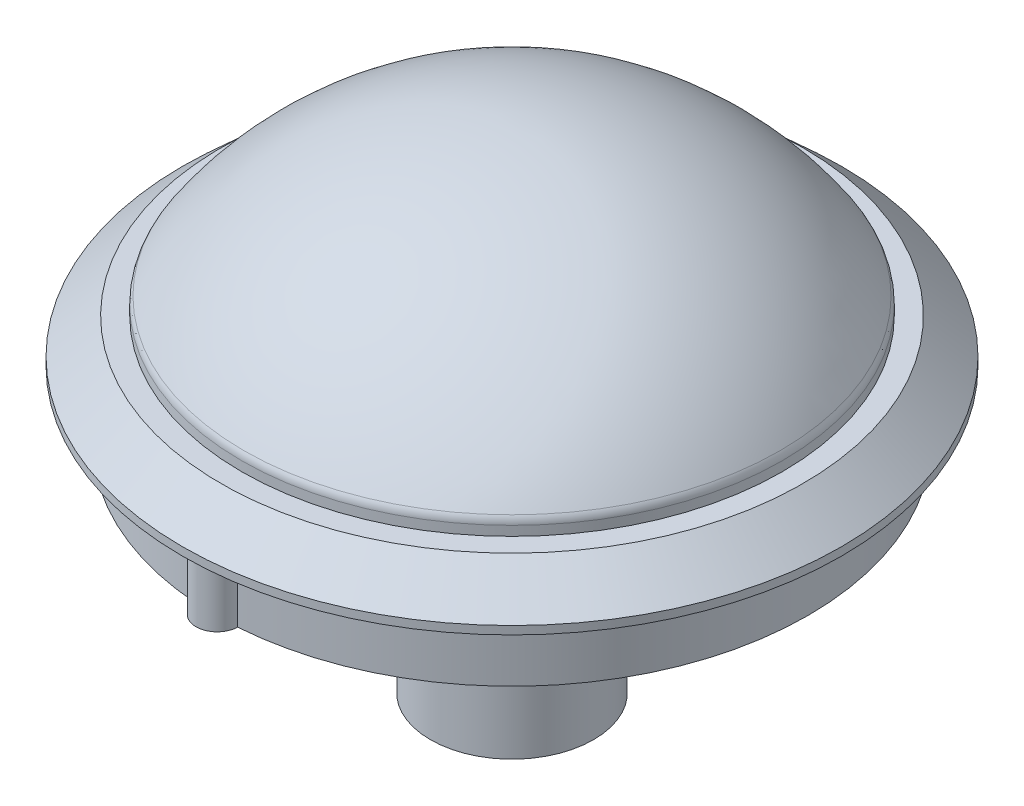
ISO-10303-21;
HEADER;
FILE_DESCRIPTION(('STEP AP214'),'2;1');
FILE_NAME('part.step','',(''),(''),'','','');
FILE_SCHEMA(('AUTOMOTIVE_DESIGN { 1 0 10303 214 1 1 1 1 }'));
ENDSEC;
DATA;
#1=APPLICATION_CONTEXT('core data for automotive mechanical design processes');
#2=APPLICATION_PROTOCOL_DEFINITION('international standard','automotive_design',2000,#1);
#3=PRODUCT_CONTEXT('',#1,'mechanical');
#4=PRODUCT('Part','Part','',(#3));
#5=PRODUCT_RELATED_PRODUCT_CATEGORY('part','',(#4));
#6=PRODUCT_DEFINITION_FORMATION('','',#4);
#7=PRODUCT_DEFINITION_CONTEXT('part definition',#1,'design');
#8=PRODUCT_DEFINITION('design','',#6,#7);
#9=PRODUCT_DEFINITION_SHAPE('','',#8);
#10=(LENGTH_UNIT() NAMED_UNIT(*) SI_UNIT(.MILLI.,.METRE.));
#11=(NAMED_UNIT(*) PLANE_ANGLE_UNIT() SI_UNIT($,.RADIAN.));
#12=(NAMED_UNIT(*) SI_UNIT($,.STERADIAN.) SOLID_ANGLE_UNIT());
#13=UNCERTAINTY_MEASURE_WITH_UNIT(LENGTH_MEASURE(1.E-05),#10,'distance_accuracy_value','');
#14=(GEOMETRIC_REPRESENTATION_CONTEXT(3) GLOBAL_UNCERTAINTY_ASSIGNED_CONTEXT((#13)) GLOBAL_UNIT_ASSIGNED_CONTEXT((#10,
#11,#12)) REPRESENTATION_CONTEXT('',''));
#15=CARTESIAN_POINT('',(0.,0.,0.));
#16=DIRECTION('',(0.,0.,1.));
#17=DIRECTION('',(1.,0.,0.));
#18=AXIS2_PLACEMENT_3D('',#15,#16,#17);
#19=CARTESIAN_POINT('',(0.,10.,0.));
#20=DIRECTION('',(0.,-1.,0.));
#21=DIRECTION('',(0.,0.,-1.));
#22=AXIS2_PLACEMENT_3D('',#19,#20,#21);
#23=CYLINDRICAL_SURFACE('',#22,43.55);
#24=CARTESIAN_POINT('',(0.,0.,0.));
#25=DIRECTION('',(0.,1.,0.));
#26=DIRECTION('',(0.,0.,1.));
#27=AXIS2_PLACEMENT_3D('',#24,#25,#26);
#28=CIRCLE('',#27,43.55);
#29=CARTESIAN_POINT('',(-3.09870430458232,0.,-43.4396193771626));
#30=VERTEX_POINT('',#29);
#31=CARTESIAN_POINT('',(-3.09870430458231,0.,43.4396193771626));
#32=VERTEX_POINT('',#31);
#33=EDGE_CURVE('E103',#30,#32,#28,.T.);
#34=ORIENTED_EDGE('',*,*,#33,.T.);
#35=DIRECTION('',(0.,-1.,0.));
#36=VECTOR('',#35,1.);
#37=CARTESIAN_POINT('',(-3.09870430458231,10.,43.4396193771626));
#38=LINE('',#37,#36);
#39=CARTESIAN_POINT('',(-3.09870430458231,10.,43.4396193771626));
#40=VERTEX_POINT('',#39);
#41=EDGE_CURVE('E88',#40,#32,#38,.T.);
#42=ORIENTED_EDGE('',*,*,#41,.F.);
#43=CARTESIAN_POINT('',(0.,10.,0.));
#44=DIRECTION('',(0.,1.,0.));
#45=DIRECTION('',(0.,0.,1.));
#46=AXIS2_PLACEMENT_3D('',#43,#44,#45);
#47=CIRCLE('',#46,43.55);
#48=CARTESIAN_POINT('',(-3.09870430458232,10.,-43.4396193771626));
#49=VERTEX_POINT('',#48);
#50=EDGE_CURVE('E84',#49,#40,#47,.T.);
#51=ORIENTED_EDGE('',*,*,#50,.F.);
#52=DIRECTION('',(0.,-1.,0.));
#53=VECTOR('',#52,1.);
#54=CARTESIAN_POINT('',(-3.09870430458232,10.,-43.4396193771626));
#55=LINE('',#54,#53);
#56=EDGE_CURVE('E86',#49,#30,#55,.T.);
#57=ORIENTED_EDGE('',*,*,#56,.T.);
#58=EDGE_LOOP('',(#34,#42,#51,#57));
#59=FACE_BOUND('',#58,.T.);
#60=ADVANCED_FACE('F34',(#59),#23,.T.);
#61=CARTESIAN_POINT('',(0.,10.,43.35));
#62=DIRECTION('',(0.,-1.,0.));
#63=DIRECTION('',(0.,0.,-1.));
#64=AXIS2_PLACEMENT_3D('',#61,#62,#63);
#65=CYLINDRICAL_SURFACE('',#64,3.1);
#66=CARTESIAN_POINT('',(0.,0.,43.35));
#67=DIRECTION('',(0.,1.,0.));
#68=DIRECTION('',(0.,0.,-1.));
#69=AXIS2_PLACEMENT_3D('',#66,#67,#68);
#70=CIRCLE('',#69,3.1);
#71=CARTESIAN_POINT('',(3.09870430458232,0.,43.4396193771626));
#72=VERTEX_POINT('',#71);
#73=EDGE_CURVE('E105',#32,#72,#70,.T.);
#74=ORIENTED_EDGE('',*,*,#73,.T.);
#75=DIRECTION('',(0.,-1.,0.));
#76=VECTOR('',#75,1.);
#77=CARTESIAN_POINT('',(3.09870430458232,10.,43.4396193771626));
#78=LINE('',#77,#76);
#79=CARTESIAN_POINT('',(3.09870430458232,10.,43.4396193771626));
#80=VERTEX_POINT('',#79);
#81=EDGE_CURVE('E111',#80,#72,#78,.T.);
#82=ORIENTED_EDGE('',*,*,#81,.F.);
#83=CARTESIAN_POINT('',(0.,10.,43.35));
#84=DIRECTION('',(0.,1.,0.));
#85=DIRECTION('',(0.,0.,-1.));
#86=AXIS2_PLACEMENT_3D('',#83,#84,#85);
#87=CIRCLE('',#86,3.1);
#88=EDGE_CURVE('E78',#40,#80,#87,.T.);
#89=ORIENTED_EDGE('',*,*,#88,.F.);
#90=ORIENTED_EDGE('',*,*,#41,.T.);
#91=EDGE_LOOP('',(#74,#82,#89,#90));
#92=FACE_BOUND('',#91,.T.);
#93=ADVANCED_FACE('F134',(#92),#65,.T.);
#94=CARTESIAN_POINT('',(0.,10.,0.));
#95=DIRECTION('',(0.,-1.,0.));
#96=DIRECTION('',(0.,0.,-1.));
#97=AXIS2_PLACEMENT_3D('',#94,#95,#96);
#98=CYLINDRICAL_SURFACE('',#97,43.55);
#99=CARTESIAN_POINT('',(0.,0.,0.));
#100=DIRECTION('',(0.,1.,0.));
#101=DIRECTION('',(0.,0.,1.));
#102=AXIS2_PLACEMENT_3D('',#99,#100,#101);
#103=CIRCLE('',#102,43.55);
#104=CARTESIAN_POINT('',(3.09870430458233,0.,-43.4396193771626));
#105=VERTEX_POINT('',#104);
#106=EDGE_CURVE('E67',#72,#105,#103,.T.);
#107=ORIENTED_EDGE('',*,*,#106,.T.);
#108=DIRECTION('',(0.,-1.,0.));
#109=VECTOR('',#108,1.);
#110=CARTESIAN_POINT('',(3.09870430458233,10.,-43.4396193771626));
#111=LINE('',#110,#109);
#112=CARTESIAN_POINT('',(3.09870430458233,10.,-43.4396193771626));
#113=VERTEX_POINT('',#112);
#114=EDGE_CURVE('E51',#113,#105,#111,.T.);
#115=ORIENTED_EDGE('',*,*,#114,.F.);
#116=CARTESIAN_POINT('',(0.,10.,0.));
#117=DIRECTION('',(0.,1.,0.));
#118=DIRECTION('',(0.,0.,1.));
#119=AXIS2_PLACEMENT_3D('',#116,#117,#118);
#120=CIRCLE('',#119,43.55);
#121=EDGE_CURVE('E98',#80,#113,#120,.T.);
#122=ORIENTED_EDGE('',*,*,#121,.F.);
#123=ORIENTED_EDGE('',*,*,#81,.T.);
#124=EDGE_LOOP('',(#107,#115,#122,#123));
#125=FACE_BOUND('',#124,.T.);
#126=ADVANCED_FACE('F138',(#125),#98,.T.);
#127=CARTESIAN_POINT('',(0.,10.,-43.35));
#128=DIRECTION('',(0.,-1.,0.));
#129=DIRECTION('',(0.,0.,-1.));
#130=AXIS2_PLACEMENT_3D('',#127,#128,#129);
#131=CYLINDRICAL_SURFACE('',#130,3.1);
#132=CARTESIAN_POINT('',(0.,0.,-43.35));
#133=DIRECTION('',(0.,1.,0.));
#134=DIRECTION('',(0.,0.,1.));
#135=AXIS2_PLACEMENT_3D('',#132,#133,#134);
#136=CIRCLE('',#135,3.1);
#137=EDGE_CURVE('E72',#105,#30,#136,.T.);
#138=ORIENTED_EDGE('',*,*,#137,.T.);
#139=ORIENTED_EDGE('',*,*,#56,.F.);
#140=CARTESIAN_POINT('',(0.,10.,-43.35));
#141=DIRECTION('',(0.,1.,0.));
#142=DIRECTION('',(0.,0.,1.));
#143=AXIS2_PLACEMENT_3D('',#140,#141,#142);
#144=CIRCLE('',#143,3.1);
#145=EDGE_CURVE('E93',#113,#49,#144,.T.);
#146=ORIENTED_EDGE('',*,*,#145,.F.);
#147=ORIENTED_EDGE('',*,*,#114,.T.);
#148=EDGE_LOOP('',(#138,#139,#146,#147));
#149=FACE_BOUND('',#148,.T.);
#150=ADVANCED_FACE('F92',(#149),#131,.T.);
#151=CARTESIAN_POINT('',(0.,0.,21.675));
#152=DIRECTION('',(0.,1.,0.));
#153=DIRECTION('',(0.,0.,1.));
#154=AXIS2_PLACEMENT_3D('',#151,#152,#153);
#155=PLANE('',#154);
#156=CARTESIAN_POINT('',(0.,0.,0.));
#157=DIRECTION('',(0.,1.,0.));
#158=DIRECTION('',(0.,0.,1.));
#159=AXIS2_PLACEMENT_3D('',#156,#157,#158);
#160=CIRCLE('',#159,12.);
#161=CARTESIAN_POINT('',(0.,0.,12.));
#162=VERTEX_POINT('',#161);
#163=EDGE_CURVE('E114',#162,#162,#160,.F.);
#164=ORIENTED_EDGE('',*,*,#163,.F.);
#165=EDGE_LOOP('',(#164));
#166=FACE_BOUND('',#165,.T.);
#167=ORIENTED_EDGE('',*,*,#33,.F.);
#168=ORIENTED_EDGE('',*,*,#137,.F.);
#169=ORIENTED_EDGE('',*,*,#106,.F.);
#170=ORIENTED_EDGE('',*,*,#73,.F.);
#171=EDGE_LOOP('',(#167,#168,#169,#170));
#172=FACE_BOUND('',#171,.T.);
#173=ADVANCED_FACE('F145',(#166,#172),#155,.F.);
#174=CARTESIAN_POINT('',(0.,11.2,0.));
#175=DIRECTION('',(0.,-1.,0.));
#176=DIRECTION('',(0.,0.,-1.));
#177=AXIS2_PLACEMENT_3D('',#174,#175,#176);
#178=CONICAL_SURFACE('',#177,48.45,0.829031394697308);
#179=CARTESIAN_POINT('',(0.,16.4,0.));
#180=DIRECTION('',(0.,-1.,0.));
#181=DIRECTION('',(0.,0.,-1.));
#182=AXIS2_PLACEMENT_3D('',#179,#180,#181);
#183=CIRCLE('',#182,42.7751957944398);
#184=CARTESIAN_POINT('',(0.,16.4,-42.7751957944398));
#185=VERTEX_POINT('',#184);
#186=EDGE_CURVE('E106',#185,#185,#183,.T.);
#187=ORIENTED_EDGE('',*,*,#186,.T.);
#188=EDGE_LOOP('',(#187));
#189=FACE_BOUND('',#188,.T.);
#190=CARTESIAN_POINT('',(0.,11.2,0.));
#191=DIRECTION('',(0.,-1.,0.));
#192=DIRECTION('',(0.,0.,-1.));
#193=AXIS2_PLACEMENT_3D('',#190,#191,#192);
#194=CIRCLE('',#193,48.45);
#195=CARTESIAN_POINT('',(0.,11.2,-48.45));
#196=VERTEX_POINT('',#195);
#197=EDGE_CURVE('E262',#196,#196,#194,.T.);
#198=ORIENTED_EDGE('',*,*,#197,.F.);
#199=EDGE_LOOP('',(#198));
#200=FACE_BOUND('',#199,.T.);
#201=ADVANCED_FACE('F148',(#189,#200),#178,.T.);
#202=CARTESIAN_POINT('',(0.,16.4,-39.65));
#203=DIRECTION('',(0.,1.,0.));
#204=DIRECTION('',(0.,0.,1.));
#205=AXIS2_PLACEMENT_3D('',#202,#203,#204);
#206=PLANE('',#205);
#207=CARTESIAN_POINT('',(0.,16.4,0.));
#208=DIRECTION('',(0.,1.,0.));
#209=DIRECTION('',(0.,0.,1.));
#210=AXIS2_PLACEMENT_3D('',#207,#208,#209);
#211=CIRCLE('',#210,39.75);
#212=CARTESIAN_POINT('',(0.,16.4,39.75));
#213=VERTEX_POINT('',#212);
#214=EDGE_CURVE('E117',#213,#213,#211,.T.);
#215=ORIENTED_EDGE('',*,*,#214,.F.);
#216=EDGE_LOOP('',(#215));
#217=FACE_BOUND('',#216,.T.);
#218=ORIENTED_EDGE('',*,*,#186,.F.);
#219=EDGE_LOOP('',(#218));
#220=FACE_BOUND('',#219,.T.);
#221=ADVANCED_FACE('F152',(#217,#220),#206,.T.);
#222=CARTESIAN_POINT('',(0.,10.,0.));
#223=DIRECTION('',(0.,-1.,0.));
#224=DIRECTION('',(0.,0.,-1.));
#225=AXIS2_PLACEMENT_3D('',#222,#223,#224);
#226=PLANE('',#225);
#227=ORIENTED_EDGE('',*,*,#50,.T.);
#228=ORIENTED_EDGE('',*,*,#88,.T.);
#229=ORIENTED_EDGE('',*,*,#121,.T.);
#230=ORIENTED_EDGE('',*,*,#145,.T.);
#231=EDGE_LOOP('',(#227,#228,#229,#230));
#232=FACE_BOUND('',#231,.T.);
#233=CARTESIAN_POINT('',(0.,10.,0.));
#234=DIRECTION('',(0.,-1.,0.));
#235=DIRECTION('',(0.,0.,-1.));
#236=AXIS2_PLACEMENT_3D('',#233,#234,#235);
#237=CIRCLE('',#236,48.45);
#238=CARTESIAN_POINT('',(0.,10.,-48.45));
#239=VERTEX_POINT('',#238);
#240=EDGE_CURVE('E265',#239,#239,#237,.T.);
#241=ORIENTED_EDGE('',*,*,#240,.T.);
#242=EDGE_LOOP('',(#241));
#243=FACE_BOUND('',#242,.T.);
#244=ADVANCED_FACE('F96',(#232,#243),#226,.T.);
#245=CARTESIAN_POINT('',(0.,-3.35540193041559,0.));
#246=DIRECTION('',(0.,-1.,0.));
#247=DIRECTION('',(0.,0.,-1.));
#248=AXIS2_PLACEMENT_3D('',#245,#246,#247);
#249=CYLINDRICAL_SURFACE('',#248,48.45);
#250=ORIENTED_EDGE('',*,*,#197,.T.);
#251=EDGE_LOOP('',(#250));
#252=FACE_BOUND('',#251,.T.);
#253=ORIENTED_EDGE('',*,*,#240,.F.);
#254=EDGE_LOOP('',(#253));
#255=FACE_BOUND('',#254,.T.);
#256=ADVANCED_FACE('F159',(#252,#255),#249,.T.);
#257=CARTESIAN_POINT('',(0.,-31.6,0.));
#258=DIRECTION('',(0.,1.,0.));
#259=DIRECTION('',(0.,0.,1.));
#260=AXIS2_PLACEMENT_3D('',#257,#258,#259);
#261=CYLINDRICAL_SURFACE('',#260,12.);
#262=CARTESIAN_POINT('',(0.,-31.6,0.));
#263=DIRECTION('',(0.,-1.,0.));
#264=DIRECTION('',(0.,0.,-1.));
#265=AXIS2_PLACEMENT_3D('',#262,#263,#264);
#266=CIRCLE('',#265,12.);
#267=CARTESIAN_POINT('',(0.,-31.6,-12.));
#268=VERTEX_POINT('',#267);
#269=EDGE_CURVE('E261',#268,#268,#266,.T.);
#270=ORIENTED_EDGE('',*,*,#269,.F.);
#271=EDGE_LOOP('',(#270));
#272=FACE_BOUND('',#271,.T.);
#273=ORIENTED_EDGE('',*,*,#163,.T.);
#274=EDGE_LOOP('',(#273));
#275=FACE_BOUND('',#274,.T.);
#276=ADVANCED_FACE('F162',(#272,#275),#261,.T.);
#277=CARTESIAN_POINT('',(0.,-31.6,0.));
#278=DIRECTION('',(0.,-1.,0.));
#279=DIRECTION('',(0.,0.,-1.));
#280=AXIS2_PLACEMENT_3D('',#277,#278,#279);
#281=PLANE('',#280);
#282=ORIENTED_EDGE('',*,*,#269,.T.);
#283=EDGE_LOOP('',(#282));
#284=FACE_BOUND('',#283,.T.);
#285=ADVANCED_FACE('F166',(#284),#281,.T.);
#286=CARTESIAN_POINT('',(0.,-7.37552083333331,0.));
#287=DIRECTION('',(0.,-1.,0.));
#288=DIRECTION('',(0.,0.,-1.));
#289=AXIS2_PLACEMENT_3D('',#286,#287,#288);
#290=SPHERICAL_SURFACE('',#289,47.3755208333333);
#291=CARTESIAN_POINT('',(0.,18.911073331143,0.));
#292=DIRECTION('',(0.,-1.,0.));
#293=DIRECTION('',(0.,0.,-1.));
#294=AXIS2_PLACEMENT_3D('',#291,#292,#293);
#295=CIRCLE('',#294,39.4138927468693);
#296=CARTESIAN_POINT('',(0.,18.911073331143,-39.4138927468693));
#297=VERTEX_POINT('',#296);
#298=EDGE_CURVE('E11',#297,#297,#295,.F.);
#299=ORIENTED_EDGE('',*,*,#298,.T.);
#300=EDGE_LOOP('',(#299));
#301=FACE_BOUND('',#300,.T.);
#302=ADVANCED_FACE('F130',(#301),#290,.T.);
#303=CARTESIAN_POINT('',(0.,12.,0.));
#304=DIRECTION('',(0.,-1.,0.));
#305=DIRECTION('',(0.,0.,-1.));
#306=AXIS2_PLACEMENT_3D('',#303,#304,#305);
#307=CYLINDRICAL_SURFACE('',#306,39.75);
#308=CARTESIAN_POINT('',(0.,17.80136123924,0.));
#309=DIRECTION('',(0.,-1.,0.));
#310=DIRECTION('',(0.,0.,-1.));
#311=AXIS2_PLACEMENT_3D('',#308,#309,#310);
#312=CIRCLE('',#311,39.75);
#313=CARTESIAN_POINT('',(0.,17.80136123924,-39.75));
#314=VERTEX_POINT('',#313);
#315=EDGE_CURVE('E43',#314,#314,#312,.T.);
#316=ORIENTED_EDGE('',*,*,#315,.T.);
#317=EDGE_LOOP('',(#316));
#318=FACE_BOUND('',#317,.T.);
#319=ORIENTED_EDGE('',*,*,#214,.T.);
#320=EDGE_LOOP('',(#319));
#321=FACE_BOUND('',#320,.T.);
#322=ADVANCED_FACE('F122',(#318,#321),#307,.T.);
#323=CARTESIAN_POINT('',(0.,17.80136123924,0.));
#324=DIRECTION('',(0.,-1.,0.));
#325=DIRECTION('',(0.,0.,-1.));
#326=AXIS2_PLACEMENT_3D('',#323,#324,#325);
#327=TOROIDAL_SURFACE('',#326,37.75,2.);
#328=ORIENTED_EDGE('',*,*,#298,.F.);
#329=EDGE_LOOP('',(#328));
#330=FACE_BOUND('',#329,.T.);
#331=ORIENTED_EDGE('',*,*,#315,.F.);
#332=EDGE_LOOP('',(#331));
#333=FACE_BOUND('',#332,.T.);
#334=ADVANCED_FACE('F36',(#330,#333),#327,.T.);
#335=CLOSED_SHELL('',(#60,#93,#126,#150,#173,#201,#221,#244,#256,#276,#285,#302,#322,#334));
#336=MANIFOLD_SOLID_BREP('B2',#335);
#337=ADVANCED_BREP_SHAPE_REPRESENTATION('',(#18,#336),#14);
#338=SHAPE_DEFINITION_REPRESENTATION(#9,#337);
ENDSEC;
END-ISO-10303-21;
